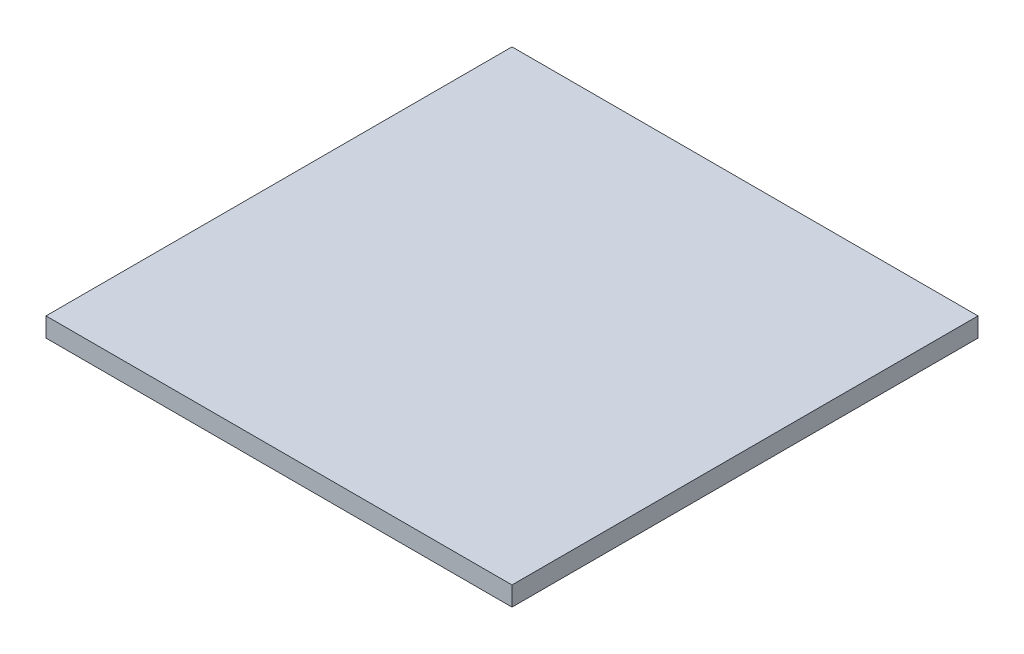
from build123d import *

# Parameters (mm, degrees)
SKETCH1_W           = 30.25
SKETCH1_H           = 30.25
BOSS_EXTRUDE1_DEPTH = 1.25


with BuildPart() as part:
    # Sketch1 → Boss-Extrude1 (new body)
    with BuildSketch(Plane(origin=(0, 0, 0), x_dir=(1, 0, 0), z_dir=(0, 1, 0))):
        Rectangle(SKETCH1_W, SKETCH1_H)
    extrude(amount=BOSS_EXTRUDE1_DEPTH)


solid = part.part
